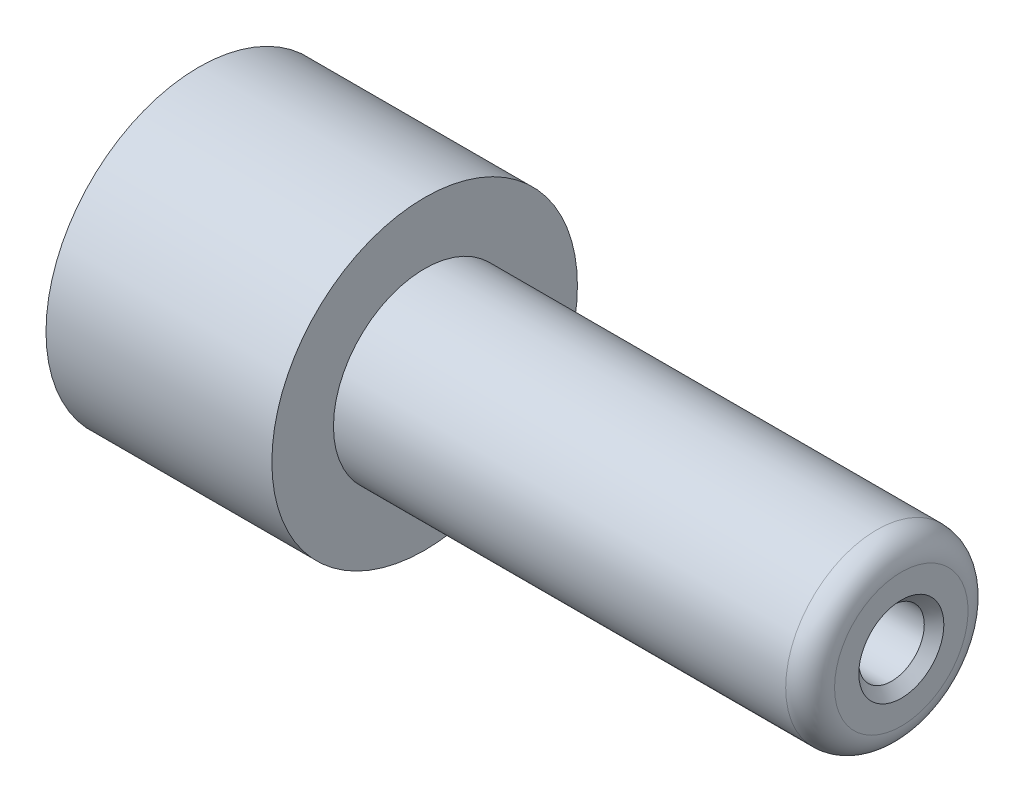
from build123d import *

# Parameters (mm, degrees)
SKETCH2_R          = 1.1811
CUT_EXTRUDE1_DEPTH = 2.3876
SKETCH3_R          = 1.7018
CUT_EXTRUDE2_DEPTH = 9.525
CHAMFER1_SIZE      = 0.508


with BuildPart() as part:
    # Sketch1 → Revolve1 (revolve)
    with BuildSketch(Plane.XY, mode=Mode.PRIVATE) as revolve1_sk:
        with BuildLine():
            Line((0, 3.5687), (0, 7.9375))
            Line((0, 7.9375), (11.7348, 7.9375))
            Line((11.7348, 7.9375), (11.7348, 4.7371))
            Line((11.7348, 4.7371), (35.2298, 4.7371))
            ThreePointArc((35.2298, 4.7371), (36.127825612, 4.365125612), (36.4998, 3.4671))
            Line((36.4998, 3.4671), (36.4998, 0))
            Line((36.4998, 0), (24.4856, 0))
            Line((24.4856, 0), (24.4856, 3.5687))
            Line((24.4856, 3.5687), (0, 3.5687))
        make_face()
    revolve(revolve1_sk.sketch.rotate(Axis((0, 0, 0), (1, 0, 0)), 90), axis=Axis((0, 0, 0), (1, 0, 0)))

    # Sketch2 → Cut-Extrude1 (cut)
    with BuildSketch(Plane.ZY):
        with Locations((0, 5.5499)):
            Circle(SKETCH2_R)
        with Locations(Location((0, -5.5499, 0), (0, 0, 180))):
            Circle(SKETCH2_R)
    extrude(amount=-CUT_EXTRUDE1_DEPTH, mode=Mode.SUBTRACT)

    # Sketch3 → Cut-Extrude2 (cut)
    with BuildSketch(Plane(origin=(36.4998, 0, 0), x_dir=(0, 0, -1), z_dir=(1, 0, 0))):
        Circle(SKETCH3_R)
    extrude(amount=-CUT_EXTRUDE2_DEPTH, mode=Mode.SUBTRACT)

    # Chamfer1
    chamfer1_edges = [part.edges().sort_by_distance(p)[0] for p in [
        (36.4998, 0, 1.7018),
    ]]
    chamfer(chamfer1_edges, length=CHAMFER1_SIZE)


solid = part.part
